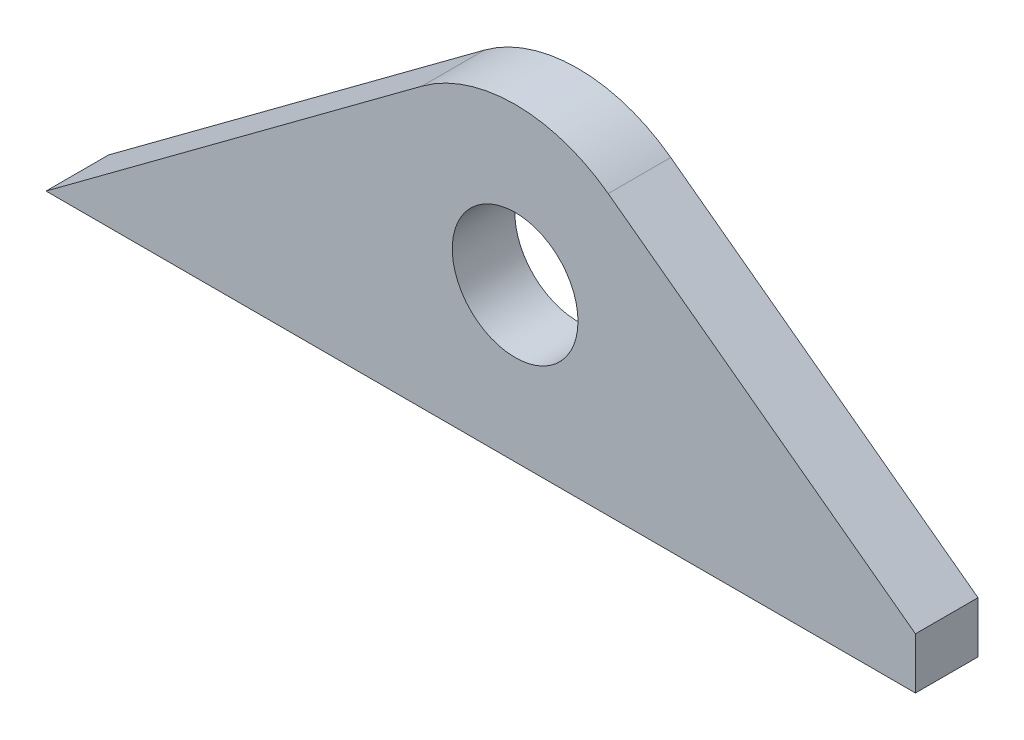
ISO-10303-21;
HEADER;
FILE_DESCRIPTION(('STEP AP214'),'2;1');
FILE_NAME('part.step','',(''),(''),'','','');
FILE_SCHEMA(('AUTOMOTIVE_DESIGN { 1 0 10303 214 1 1 1 1 }'));
ENDSEC;
DATA;
#1=APPLICATION_CONTEXT('core data for automotive mechanical design processes');
#2=APPLICATION_PROTOCOL_DEFINITION('international standard','automotive_design',2000,#1);
#3=PRODUCT_CONTEXT('',#1,'mechanical');
#4=PRODUCT('Part','Part','',(#3));
#5=PRODUCT_RELATED_PRODUCT_CATEGORY('part','',(#4));
#6=PRODUCT_DEFINITION_FORMATION('','',#4);
#7=PRODUCT_DEFINITION_CONTEXT('part definition',#1,'design');
#8=PRODUCT_DEFINITION('design','',#6,#7);
#9=PRODUCT_DEFINITION_SHAPE('','',#8);
#10=(LENGTH_UNIT() NAMED_UNIT(*) SI_UNIT(.MILLI.,.METRE.));
#11=(NAMED_UNIT(*) PLANE_ANGLE_UNIT() SI_UNIT($,.RADIAN.));
#12=(NAMED_UNIT(*) SI_UNIT($,.STERADIAN.) SOLID_ANGLE_UNIT());
#13=UNCERTAINTY_MEASURE_WITH_UNIT(LENGTH_MEASURE(1.E-05),#10,'distance_accuracy_value','');
#14=(GEOMETRIC_REPRESENTATION_CONTEXT(3) GLOBAL_UNCERTAINTY_ASSIGNED_CONTEXT((#13)) GLOBAL_UNIT_ASSIGNED_CONTEXT((#10,
#11,#12)) REPRESENTATION_CONTEXT('',''));
#15=CARTESIAN_POINT('',(0.,0.,0.));
#16=DIRECTION('',(0.,0.,1.));
#17=DIRECTION('',(1.,0.,0.));
#18=AXIS2_PLACEMENT_3D('',#15,#16,#17);
#19=CARTESIAN_POINT('',(0.,0.,10.));
#20=DIRECTION('',(0.,0.,-1.));
#21=DIRECTION('',(-1.,0.,0.));
#22=AXIS2_PLACEMENT_3D('',#19,#20,#21);
#23=PLANE('',#22);
#24=DIRECTION('',(0.,1.,0.));
#25=VECTOR('',#24,1.);
#26=CARTESIAN_POINT('',(64.,-16.3,10.));
#27=LINE('',#26,#25);
#28=CARTESIAN_POINT('',(64.,-24.5,10.));
#29=VERTEX_POINT('',#28);
#30=CARTESIAN_POINT('',(64.,-16.3,10.));
#31=VERTEX_POINT('',#30);
#32=EDGE_CURVE('E108',#29,#31,#27,.T.);
#33=ORIENTED_EDGE('',*,*,#32,.T.);
#34=DIRECTION('',(-0.803523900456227,0.595272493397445,0.));
#35=VECTOR('',#34,1.);
#36=CARTESIAN_POINT('',(14.8818123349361,20.0880975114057,10.));
#37=LINE('',#36,#35);
#38=CARTESIAN_POINT('',(14.8818123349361,20.0880975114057,10.));
#39=VERTEX_POINT('',#38);
#40=EDGE_CURVE('E91',#31,#39,#37,.T.);
#41=ORIENTED_EDGE('',*,*,#40,.T.);
#42=CARTESIAN_POINT('',(0.,0.,10.));
#43=DIRECTION('',(0.,0.,1.));
#44=DIRECTION('',(-1.,0.,0.));
#45=AXIS2_PLACEMENT_3D('',#42,#43,#44);
#46=CIRCLE('',#45,25.);
#47=CARTESIAN_POINT('',(-14.892787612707,20.0799620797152,10.));
#48=VERTEX_POINT('',#47);
#49=EDGE_CURVE('E111',#39,#48,#46,.T.);
#50=ORIENTED_EDGE('',*,*,#49,.T.);
#51=DIRECTION('',(-0.803198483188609,-0.595711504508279,0.));
#52=VECTOR('',#51,1.);
#53=CARTESIAN_POINT('',(-75.,-24.5,10.));
#54=LINE('',#53,#52);
#55=CARTESIAN_POINT('',(-75.,-24.5,10.));
#56=VERTEX_POINT('',#55);
#57=EDGE_CURVE('E50',#48,#56,#54,.T.);
#58=ORIENTED_EDGE('',*,*,#57,.T.);
#59=DIRECTION('',(1.,0.,0.));
#60=VECTOR('',#59,1.);
#61=CARTESIAN_POINT('',(64.,-24.5,10.));
#62=LINE('',#61,#60);
#63=EDGE_CURVE('E45',#56,#29,#62,.T.);
#64=ORIENTED_EDGE('',*,*,#63,.T.);
#65=EDGE_LOOP('',(#33,#41,#50,#58,#64));
#66=FACE_BOUND('',#65,.T.);
#67=CARTESIAN_POINT('',(0.,0.,10.));
#68=DIRECTION('',(0.,0.,1.));
#69=DIRECTION('',(1.,0.,0.));
#70=AXIS2_PLACEMENT_3D('',#67,#68,#69);
#71=CIRCLE('',#70,10.05);
#72=CARTESIAN_POINT('',(10.05,0.,10.));
#73=VERTEX_POINT('',#72);
#74=EDGE_CURVE('E96',#73,#73,#71,.T.);
#75=ORIENTED_EDGE('',*,*,#74,.F.);
#76=EDGE_LOOP('',(#75));
#77=FACE_BOUND('',#76,.T.);
#78=ADVANCED_FACE('F30',(#66,#77),#23,.F.);
#79=CARTESIAN_POINT('',(0.,0.,0.));
#80=DIRECTION('',(0.,0.,-1.));
#81=DIRECTION('',(-1.,0.,0.));
#82=AXIS2_PLACEMENT_3D('',#79,#80,#81);
#83=PLANE('',#82);
#84=DIRECTION('',(0.,1.,0.));
#85=VECTOR('',#84,1.);
#86=CARTESIAN_POINT('',(64.,-16.3,0.));
#87=LINE('',#86,#85);
#88=CARTESIAN_POINT('',(64.,-24.5,0.));
#89=VERTEX_POINT('',#88);
#90=CARTESIAN_POINT('',(64.,-16.3,0.));
#91=VERTEX_POINT('',#90);
#92=EDGE_CURVE('E82',#89,#91,#87,.T.);
#93=ORIENTED_EDGE('',*,*,#92,.F.);
#94=DIRECTION('',(1.,0.,0.));
#95=VECTOR('',#94,1.);
#96=CARTESIAN_POINT('',(64.,-24.5,0.));
#97=LINE('',#96,#95);
#98=CARTESIAN_POINT('',(-75.,-24.5,0.));
#99=VERTEX_POINT('',#98);
#100=EDGE_CURVE('E106',#99,#89,#97,.T.);
#101=ORIENTED_EDGE('',*,*,#100,.F.);
#102=DIRECTION('',(-0.803198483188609,-0.595711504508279,0.));
#103=VECTOR('',#102,1.);
#104=CARTESIAN_POINT('',(-75.,-24.5,0.));
#105=LINE('',#104,#103);
#106=CARTESIAN_POINT('',(-14.892787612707,20.0799620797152,0.));
#107=VERTEX_POINT('',#106);
#108=EDGE_CURVE('E104',#107,#99,#105,.T.);
#109=ORIENTED_EDGE('',*,*,#108,.F.);
#110=CARTESIAN_POINT('',(0.,0.,0.));
#111=DIRECTION('',(0.,0.,1.));
#112=DIRECTION('',(-1.,0.,0.));
#113=AXIS2_PLACEMENT_3D('',#110,#111,#112);
#114=CIRCLE('',#113,25.);
#115=CARTESIAN_POINT('',(14.8818123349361,20.0880975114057,0.));
#116=VERTEX_POINT('',#115);
#117=EDGE_CURVE('E84',#116,#107,#114,.T.);
#118=ORIENTED_EDGE('',*,*,#117,.F.);
#119=DIRECTION('',(-0.803523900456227,0.595272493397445,0.));
#120=VECTOR('',#119,1.);
#121=CARTESIAN_POINT('',(14.8818123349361,20.0880975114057,0.));
#122=LINE('',#121,#120);
#123=EDGE_CURVE('E77',#91,#116,#122,.T.);
#124=ORIENTED_EDGE('',*,*,#123,.F.);
#125=EDGE_LOOP('',(#93,#101,#109,#118,#124));
#126=FACE_BOUND('',#125,.T.);
#127=CARTESIAN_POINT('',(0.,0.,0.));
#128=DIRECTION('',(0.,0.,1.));
#129=DIRECTION('',(1.,0.,0.));
#130=AXIS2_PLACEMENT_3D('',#127,#128,#129);
#131=CIRCLE('',#130,10.05);
#132=CARTESIAN_POINT('',(10.05,0.,0.));
#133=VERTEX_POINT('',#132);
#134=EDGE_CURVE('E99',#133,#133,#131,.T.);
#135=ORIENTED_EDGE('',*,*,#134,.T.);
#136=EDGE_LOOP('',(#135));
#137=FACE_BOUND('',#136,.T.);
#138=ADVANCED_FACE('F78',(#126,#137),#83,.T.);
#139=CARTESIAN_POINT('',(64.,-16.3,10.));
#140=DIRECTION('',(-1.,0.,0.));
#141=DIRECTION('',(0.,-1.,0.));
#142=AXIS2_PLACEMENT_3D('',#139,#140,#141);
#143=PLANE('',#142);
#144=ORIENTED_EDGE('',*,*,#92,.T.);
#145=DIRECTION('',(0.,0.,-1.));
#146=VECTOR('',#145,1.);
#147=CARTESIAN_POINT('',(64.,-16.3,10.));
#148=LINE('',#147,#146);
#149=EDGE_CURVE('E11',#31,#91,#148,.T.);
#150=ORIENTED_EDGE('',*,*,#149,.F.);
#151=ORIENTED_EDGE('',*,*,#32,.F.);
#152=DIRECTION('',(0.,0.,-1.));
#153=VECTOR('',#152,1.);
#154=CARTESIAN_POINT('',(64.,-24.5,10.));
#155=LINE('',#154,#153);
#156=EDGE_CURVE('E95',#29,#89,#155,.T.);
#157=ORIENTED_EDGE('',*,*,#156,.T.);
#158=EDGE_LOOP('',(#144,#150,#151,#157));
#159=FACE_BOUND('',#158,.T.);
#160=ADVANCED_FACE('F32',(#159),#143,.F.);
#161=CARTESIAN_POINT('',(14.8818123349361,20.0880975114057,10.));
#162=DIRECTION('',(-0.595272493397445,-0.803523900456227,0.));
#163=DIRECTION('',(0.803523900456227,-0.595272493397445,0.));
#164=AXIS2_PLACEMENT_3D('',#161,#162,#163);
#165=PLANE('',#164);
#166=ORIENTED_EDGE('',*,*,#123,.T.);
#167=DIRECTION('',(0.,0.,-1.));
#168=VECTOR('',#167,1.);
#169=CARTESIAN_POINT('',(14.8818123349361,20.0880975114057,10.));
#170=LINE('',#169,#168);
#171=EDGE_CURVE('E38',#39,#116,#170,.T.);
#172=ORIENTED_EDGE('',*,*,#171,.F.);
#173=ORIENTED_EDGE('',*,*,#40,.F.);
#174=ORIENTED_EDGE('',*,*,#149,.T.);
#175=EDGE_LOOP('',(#166,#172,#173,#174));
#176=FACE_BOUND('',#175,.T.);
#177=ADVANCED_FACE('F90',(#176),#165,.F.);
#178=CARTESIAN_POINT('',(0.,0.,10.));
#179=DIRECTION('',(0.,0.,-1.));
#180=DIRECTION('',(-1.,0.,0.));
#181=AXIS2_PLACEMENT_3D('',#178,#179,#180);
#182=CYLINDRICAL_SURFACE('',#181,25.);
#183=ORIENTED_EDGE('',*,*,#117,.T.);
#184=DIRECTION('',(0.,0.,-1.));
#185=VECTOR('',#184,1.);
#186=CARTESIAN_POINT('',(-14.892787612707,20.0799620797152,10.));
#187=LINE('',#186,#185);
#188=EDGE_CURVE('E119',#48,#107,#187,.T.);
#189=ORIENTED_EDGE('',*,*,#188,.F.);
#190=ORIENTED_EDGE('',*,*,#49,.F.);
#191=ORIENTED_EDGE('',*,*,#171,.T.);
#192=EDGE_LOOP('',(#183,#189,#190,#191));
#193=FACE_BOUND('',#192,.T.);
#194=ADVANCED_FACE('F123',(#193),#182,.T.);
#195=CARTESIAN_POINT('',(-75.,-24.5,10.));
#196=DIRECTION('',(0.595711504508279,-0.803198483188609,0.));
#197=DIRECTION('',(0.803198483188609,0.595711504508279,0.));
#198=AXIS2_PLACEMENT_3D('',#195,#196,#197);
#199=PLANE('',#198);
#200=ORIENTED_EDGE('',*,*,#108,.T.);
#201=DIRECTION('',(0.,0.,-1.));
#202=VECTOR('',#201,1.);
#203=CARTESIAN_POINT('',(-75.,-24.5,10.));
#204=LINE('',#203,#202);
#205=EDGE_CURVE('E116',#56,#99,#204,.T.);
#206=ORIENTED_EDGE('',*,*,#205,.F.);
#207=ORIENTED_EDGE('',*,*,#57,.F.);
#208=ORIENTED_EDGE('',*,*,#188,.T.);
#209=EDGE_LOOP('',(#200,#206,#207,#208));
#210=FACE_BOUND('',#209,.T.);
#211=ADVANCED_FACE('F145',(#210),#199,.F.);
#212=CARTESIAN_POINT('',(64.,-24.5,10.));
#213=DIRECTION('',(0.,1.,0.));
#214=DIRECTION('',(-1.,0.,0.));
#215=AXIS2_PLACEMENT_3D('',#212,#213,#214);
#216=PLANE('',#215);
#217=ORIENTED_EDGE('',*,*,#100,.T.);
#218=ORIENTED_EDGE('',*,*,#156,.F.);
#219=ORIENTED_EDGE('',*,*,#63,.F.);
#220=ORIENTED_EDGE('',*,*,#205,.T.);
#221=EDGE_LOOP('',(#217,#218,#219,#220));
#222=FACE_BOUND('',#221,.T.);
#223=ADVANCED_FACE('F133',(#222),#216,.F.);
#224=CARTESIAN_POINT('',(0.,0.,10.));
#225=DIRECTION('',(0.,0.,-1.));
#226=DIRECTION('',(-1.,0.,0.));
#227=AXIS2_PLACEMENT_3D('',#224,#225,#226);
#228=CYLINDRICAL_SURFACE('',#227,10.05);
#229=ORIENTED_EDGE('',*,*,#74,.T.);
#230=EDGE_LOOP('',(#229));
#231=FACE_BOUND('',#230,.T.);
#232=ORIENTED_EDGE('',*,*,#134,.F.);
#233=EDGE_LOOP('',(#232));
#234=FACE_BOUND('',#233,.T.);
#235=ADVANCED_FACE('F130',(#231,#234),#228,.F.);
#236=CLOSED_SHELL('',(#78,#138,#160,#177,#194,#211,#223,#235));
#237=MANIFOLD_SOLID_BREP('B2',#236);
#238=ADVANCED_BREP_SHAPE_REPRESENTATION('',(#18,#237),#14);
#239=SHAPE_DEFINITION_REPRESENTATION(#9,#238);
ENDSEC;
END-ISO-10303-21;
